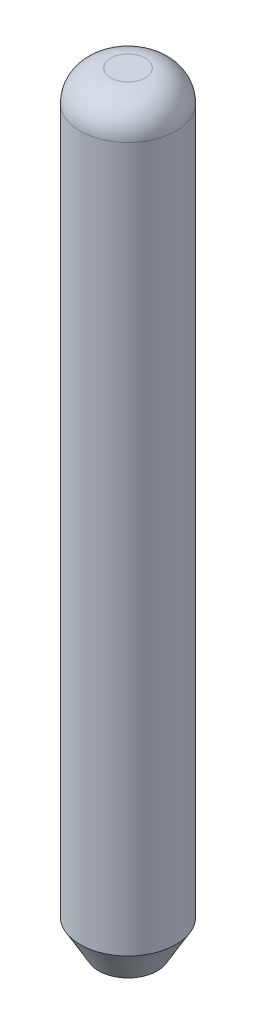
ISO-10303-21;
HEADER;
FILE_DESCRIPTION(('STEP AP214'),'2;1');
FILE_NAME('part.step','',(''),(''),'','','');
FILE_SCHEMA(('AUTOMOTIVE_DESIGN { 1 0 10303 214 1 1 1 1 }'));
ENDSEC;
DATA;
#1=APPLICATION_CONTEXT('core data for automotive mechanical design processes');
#2=APPLICATION_PROTOCOL_DEFINITION('international standard','automotive_design',2000,#1);
#3=PRODUCT_CONTEXT('',#1,'mechanical');
#4=PRODUCT('Part','Part','',(#3));
#5=PRODUCT_RELATED_PRODUCT_CATEGORY('part','',(#4));
#6=PRODUCT_DEFINITION_FORMATION('','',#4);
#7=PRODUCT_DEFINITION_CONTEXT('part definition',#1,'design');
#8=PRODUCT_DEFINITION('design','',#6,#7);
#9=PRODUCT_DEFINITION_SHAPE('','',#8);
#10=(LENGTH_UNIT() NAMED_UNIT(*) SI_UNIT(.MILLI.,.METRE.));
#11=(NAMED_UNIT(*) PLANE_ANGLE_UNIT() SI_UNIT($,.RADIAN.));
#12=(NAMED_UNIT(*) SI_UNIT($,.STERADIAN.) SOLID_ANGLE_UNIT());
#13=UNCERTAINTY_MEASURE_WITH_UNIT(LENGTH_MEASURE(1.E-05),#10,'distance_accuracy_value','');
#14=(GEOMETRIC_REPRESENTATION_CONTEXT(3) GLOBAL_UNCERTAINTY_ASSIGNED_CONTEXT((#13)) GLOBAL_UNIT_ASSIGNED_CONTEXT((#10,
#11,#12)) REPRESENTATION_CONTEXT('',''));
#15=CARTESIAN_POINT('',(0.,0.,0.));
#16=DIRECTION('',(0.,0.,1.));
#17=DIRECTION('',(1.,0.,0.));
#18=AXIS2_PLACEMENT_3D('',#15,#16,#17);
#19=CARTESIAN_POINT('',(0.,6.09600000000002,0.));
#20=DIRECTION('',(0.,-1.,0.));
#21=DIRECTION('',(0.,0.,-1.));
#22=AXIS2_PLACEMENT_3D('',#19,#20,#21);
#23=DEGENERATE_TOROIDAL_SURFACE('',#22,0.14224,0.254,.T.);
#24=CARTESIAN_POINT('',(0.,6.35,0.));
#25=DIRECTION('',(0.,-1.,0.));
#26=DIRECTION('',(0.,0.,-1.));
#27=AXIS2_PLACEMENT_3D('',#24,#25,#26);
#28=CIRCLE('',#27,0.14224);
#29=CARTESIAN_POINT('',(0.,6.35,-0.142240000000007));
#30=VERTEX_POINT('',#29);
#31=EDGE_CURVE('E10',#30,#30,#28,.T.);
#32=ORIENTED_EDGE('',*,*,#31,.T.);
#33=EDGE_LOOP('',(#32));
#34=FACE_BOUND('',#33,.T.);
#35=CARTESIAN_POINT('',(0.,6.09600000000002,0.));
#36=DIRECTION('',(0.,-1.,0.));
#37=DIRECTION('',(0.,0.,-1.));
#38=AXIS2_PLACEMENT_3D('',#35,#36,#37);
#39=CIRCLE('',#38,0.39624);
#40=CARTESIAN_POINT('',(0.,6.09600000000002,-0.396240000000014));
#41=VERTEX_POINT('',#40);
#42=EDGE_CURVE('E48',#41,#41,#39,.T.);
#43=ORIENTED_EDGE('',*,*,#42,.F.);
#44=EDGE_LOOP('',(#43));
#45=FACE_BOUND('',#44,.T.);
#46=ADVANCED_FACE('F34',(#34,#45),#23,.T.);
#47=CARTESIAN_POINT('',(0.,6.35,0.));
#48=DIRECTION('',(0.,-1.,0.));
#49=DIRECTION('',(0.,0.,-1.));
#50=AXIS2_PLACEMENT_3D('',#47,#48,#49);
#51=PLANE('',#50);
#52=ORIENTED_EDGE('',*,*,#31,.F.);
#53=EDGE_LOOP('',(#52));
#54=FACE_BOUND('',#53,.T.);
#55=ADVANCED_FACE('F57',(#54),#51,.F.);
#56=CARTESIAN_POINT('',(0.242943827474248,0.,0.));
#57=DIRECTION('',(0.,1.,0.));
#58=DIRECTION('',(0.,0.,1.));
#59=AXIS2_PLACEMENT_3D('',#56,#57,#58);
#60=PLANE('',#59);
#61=CARTESIAN_POINT('',(0.,0.,0.));
#62=DIRECTION('',(0.,-1.,0.));
#63=DIRECTION('',(0.,0.,-1.));
#64=AXIS2_PLACEMENT_3D('',#61,#62,#63);
#65=CIRCLE('',#64,0.242943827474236);
#66=CARTESIAN_POINT('',(0.,0.,-0.242943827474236));
#67=VERTEX_POINT('',#66);
#68=EDGE_CURVE('E40',#67,#67,#65,.T.);
#69=ORIENTED_EDGE('',*,*,#68,.T.);
#70=EDGE_LOOP('',(#69));
#71=FACE_BOUND('',#70,.T.);
#72=ADVANCED_FACE('F61',(#71),#60,.F.);
#73=CARTESIAN_POINT('',(0.,0.265516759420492,0.));
#74=DIRECTION('',(0.,1.,0.));
#75=DIRECTION('',(0.,0.,1.));
#76=AXIS2_PLACEMENT_3D('',#73,#74,#75);
#77=CONICAL_SURFACE('',#76,0.39624,0.523598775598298);
#78=ORIENTED_EDGE('',*,*,#68,.F.);
#79=EDGE_LOOP('',(#78));
#80=FACE_BOUND('',#79,.T.);
#81=CARTESIAN_POINT('',(0.,0.265516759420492,0.));
#82=DIRECTION('',(0.,-1.,0.));
#83=DIRECTION('',(0.,0.,-1.));
#84=AXIS2_PLACEMENT_3D('',#81,#82,#83);
#85=CIRCLE('',#84,0.39624);
#86=CARTESIAN_POINT('',(0.,0.265516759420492,-0.396240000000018));
#87=VERTEX_POINT('',#86);
#88=EDGE_CURVE('E44',#87,#87,#85,.T.);
#89=ORIENTED_EDGE('',*,*,#88,.T.);
#90=EDGE_LOOP('',(#89));
#91=FACE_BOUND('',#90,.T.);
#92=ADVANCED_FACE('F66',(#80,#91),#77,.T.);
#93=CARTESIAN_POINT('',(0.,0.,0.));
#94=DIRECTION('',(0.,-1.,0.));
#95=DIRECTION('',(0.,0.,-1.));
#96=AXIS2_PLACEMENT_3D('',#93,#94,#95);
#97=CYLINDRICAL_SURFACE('',#96,0.39624);
#98=ORIENTED_EDGE('',*,*,#88,.F.);
#99=EDGE_LOOP('',(#98));
#100=FACE_BOUND('',#99,.T.);
#101=ORIENTED_EDGE('',*,*,#42,.T.);
#102=EDGE_LOOP('',(#101));
#103=FACE_BOUND('',#102,.T.);
#104=ADVANCED_FACE('F54',(#100,#103),#97,.T.);
#105=CLOSED_SHELL('',(#46,#55,#72,#92,#104));
#106=MANIFOLD_SOLID_BREP('B2',#105);
#107=ADVANCED_BREP_SHAPE_REPRESENTATION('',(#18,#106),#14);
#108=SHAPE_DEFINITION_REPRESENTATION(#9,#107);
ENDSEC;
END-ISO-10303-21;
